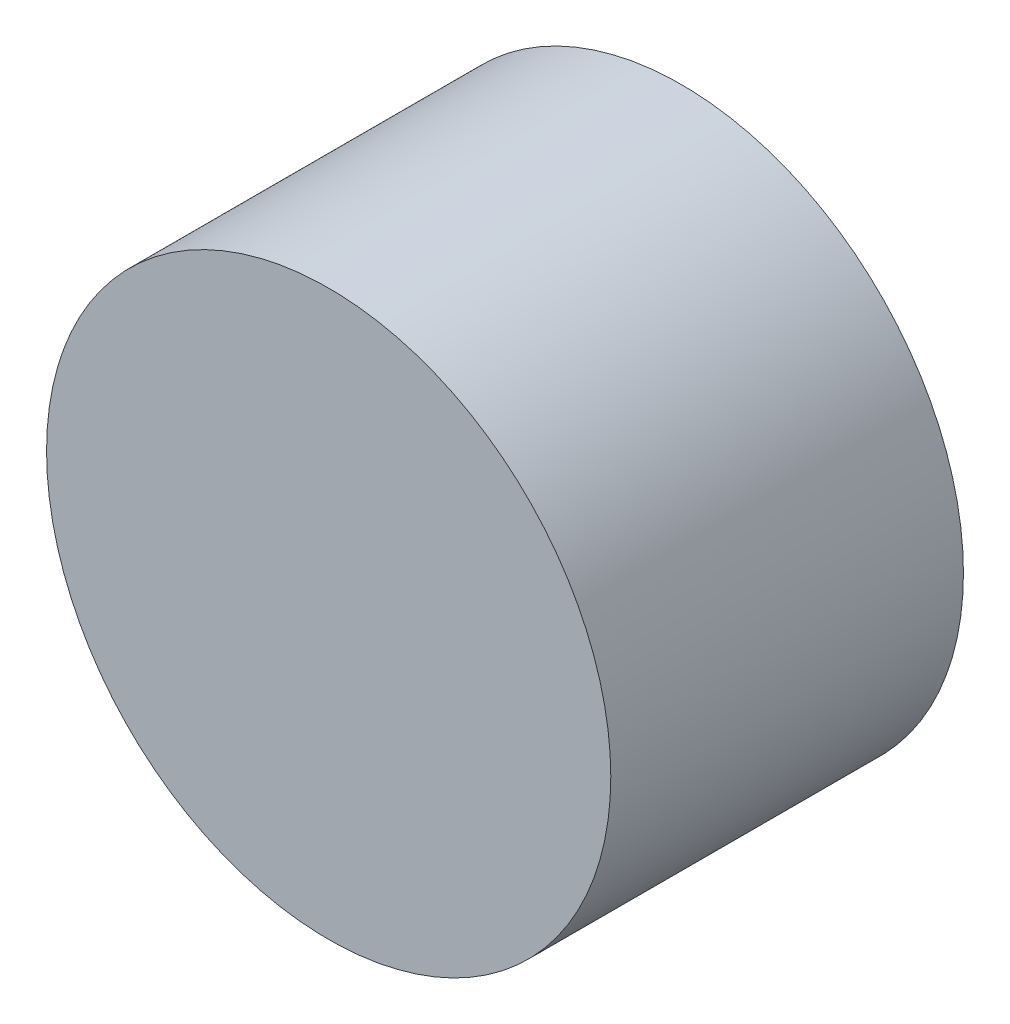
from build123d import *

# Parameters (mm, degrees)
SKETCH1_R           = 20
SKETCH1_R_2         = 2.5
BOSS_EXTRUDE1_DEPTH = 10
SKETCH2_R           = 20
BOSS_EXTRUDE2_DEPTH = 15


with BuildPart() as part:
    # Sketch1 → Boss-Extrude1 (new body)
    with BuildSketch(Plane.XY):
        Circle(SKETCH1_R)
        with Locations((0, 15)):
            Circle(SKETCH1_R_2, mode=Mode.SUBTRACT)
        with Locations((10.606601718, 10.606601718)):
            Circle(SKETCH1_R_2, mode=Mode.SUBTRACT)
        with Locations((15, 0)):
            Circle(SKETCH1_R_2, mode=Mode.SUBTRACT)
        with Locations((10.606601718, -10.606601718)):
            Circle(SKETCH1_R_2, mode=Mode.SUBTRACT)
        with Locations((0, -15)):
            Circle(SKETCH1_R_2, mode=Mode.SUBTRACT)
        with Locations((-10.606601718, -10.606601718)):
            Circle(SKETCH1_R_2, mode=Mode.SUBTRACT)
        with Locations((-15, 0)):
            Circle(SKETCH1_R_2, mode=Mode.SUBTRACT)
        with Locations((-10.606601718, 10.606601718)):
            Circle(SKETCH1_R_2, mode=Mode.SUBTRACT)
        with Locations((0, 5)):
            Circle(SKETCH1_R_2, mode=Mode.SUBTRACT)
        with Locations((5, 0)):
            Circle(SKETCH1_R_2, mode=Mode.SUBTRACT)
        with Locations((0, -5)):
            Circle(SKETCH1_R_2, mode=Mode.SUBTRACT)
        with Locations((-5, 0)):
            Circle(SKETCH1_R_2, mode=Mode.SUBTRACT)
    extrude(amount=BOSS_EXTRUDE1_DEPTH)

    # Sketch2 → Boss-Extrude2 (add)
    with BuildSketch(Plane.XY.offset(10)):
        Circle(SKETCH2_R)
    extrude(amount=BOSS_EXTRUDE2_DEPTH)


solid = part.part
